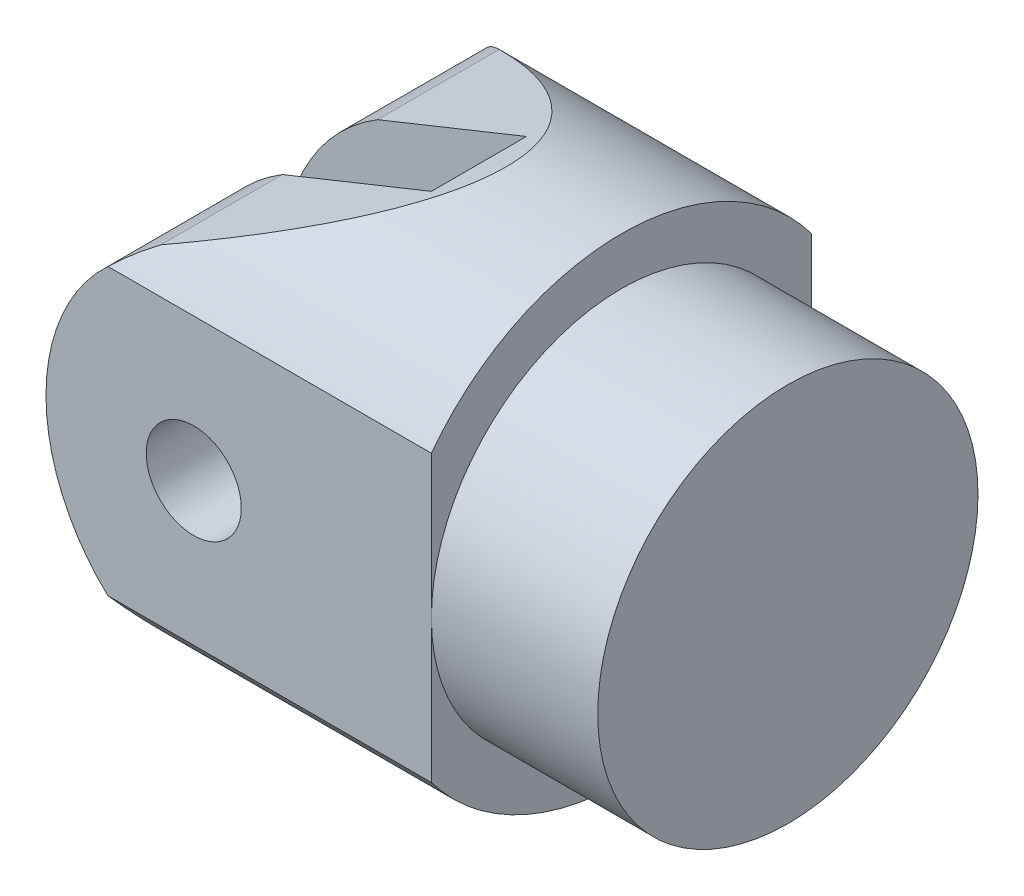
ISO-10303-21;
HEADER;
FILE_DESCRIPTION(('STEP AP214'),'2;1');
FILE_NAME('part.step','',(''),(''),'','','');
FILE_SCHEMA(('AUTOMOTIVE_DESIGN { 1 0 10303 214 1 1 1 1 }'));
ENDSEC;
DATA;
#1=APPLICATION_CONTEXT('core data for automotive mechanical design processes');
#2=APPLICATION_PROTOCOL_DEFINITION('international standard','automotive_design',2000,#1);
#3=PRODUCT_CONTEXT('',#1,'mechanical');
#4=PRODUCT('Part','Part','',(#3));
#5=PRODUCT_RELATED_PRODUCT_CATEGORY('part','',(#4));
#6=PRODUCT_DEFINITION_FORMATION('','',#4);
#7=PRODUCT_DEFINITION_CONTEXT('part definition',#1,'design');
#8=PRODUCT_DEFINITION('design','',#6,#7);
#9=PRODUCT_DEFINITION_SHAPE('','',#8);
#10=(LENGTH_UNIT() NAMED_UNIT(*) SI_UNIT(.MILLI.,.METRE.));
#11=(NAMED_UNIT(*) PLANE_ANGLE_UNIT() SI_UNIT($,.RADIAN.));
#12=(NAMED_UNIT(*) SI_UNIT($,.STERADIAN.) SOLID_ANGLE_UNIT());
#13=UNCERTAINTY_MEASURE_WITH_UNIT(LENGTH_MEASURE(1.E-05),#10,'distance_accuracy_value','');
#14=(GEOMETRIC_REPRESENTATION_CONTEXT(3) GLOBAL_UNCERTAINTY_ASSIGNED_CONTEXT((#13)) GLOBAL_UNIT_ASSIGNED_CONTEXT((#10,
#11,#12)) REPRESENTATION_CONTEXT('',''));
#15=CARTESIAN_POINT('',(0.,0.,0.));
#16=DIRECTION('',(0.,0.,1.));
#17=DIRECTION('',(1.,0.,0.));
#18=AXIS2_PLACEMENT_3D('',#15,#16,#17);
#19=CARTESIAN_POINT('',(-148.592394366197,0.,-50.));
#20=DIRECTION('',(0.373243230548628,-0.92773352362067,0.));
#21=DIRECTION('',(0.92773352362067,0.373243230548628,0.));
#22=AXIS2_PLACEMENT_3D('',#19,#20,#21);
#23=PLANE('',#22);
#24=DIRECTION('',(-0.92773352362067,-0.373243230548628,0.));
#25=VECTOR('',#24,1.);
#26=CARTESIAN_POINT('',(-148.592394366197,0.,-10.));
#27=LINE('',#26,#25);
#28=CARTESIAN_POINT('',(-30.,47.7117698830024,-10.));
#29=VERTEX_POINT('',#28);
#30=CARTESIAN_POINT('',(-61.339211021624,35.1034636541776,-10.));
#31=VERTEX_POINT('',#30);
#32=EDGE_CURVE('E140',#29,#31,#27,.T.);
#33=ORIENTED_EDGE('',*,*,#32,.F.);
#34=DIRECTION('',(0.,0.,1.));
#35=VECTOR('',#34,1.);
#36=CARTESIAN_POINT('',(-30.,47.7117698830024,-50.));
#37=LINE('',#36,#35);
#38=CARTESIAN_POINT('',(-30.,47.7117698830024,10.));
#39=VERTEX_POINT('',#38);
#40=EDGE_CURVE('E142',#29,#39,#37,.T.);
#41=ORIENTED_EDGE('',*,*,#40,.T.);
#42=DIRECTION('',(-0.92773352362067,-0.373243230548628,0.));
#43=VECTOR('',#42,1.);
#44=CARTESIAN_POINT('',(-148.592394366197,0.,10.));
#45=LINE('',#44,#43);
#46=CARTESIAN_POINT('',(-61.339211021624,35.1034636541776,10.));
#47=VERTEX_POINT('',#46);
#48=EDGE_CURVE('E126',#39,#47,#45,.T.);
#49=ORIENTED_EDGE('',*,*,#48,.T.);
#50=DIRECTION('',(0.,0.,1.));
#51=VECTOR('',#50,1.);
#52=CARTESIAN_POINT('',(-61.3392110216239,35.1034636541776,-50.));
#53=LINE('',#52,#51);
#54=CARTESIAN_POINT('',(-61.3392110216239,35.1034636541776,35.6054327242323));
#55=VERTEX_POINT('',#54);
#56=EDGE_CURVE('E167',#47,#55,#53,.T.);
#57=ORIENTED_EDGE('',*,*,#56,.T.);
#58=CARTESIAN_POINT('',(-148.592394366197,0.,0.));
#59=DIRECTION('',(0.373243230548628,-0.92773352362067,0.));
#60=DIRECTION('',(0.92773352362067,0.373243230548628,0.));
#61=AXIS2_PLACEMENT_3D('',#58,#59,#60);
#62=ELLIPSE('',#61,133.960902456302,50.);
#63=CARTESIAN_POINT('',(-61.339211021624,35.1034636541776,-35.6054327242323));
#64=VERTEX_POINT('',#63);
#65=EDGE_CURVE('E254',#55,#64,#62,.F.);
#66=ORIENTED_EDGE('',*,*,#65,.T.);
#67=EDGE_CURVE('E258',#64,#31,#53,.T.);
#68=ORIENTED_EDGE('',*,*,#67,.T.);
#69=EDGE_LOOP('',(#33,#41,#49,#57,#66,#68));
#70=FACE_BOUND('',#69,.T.);
#71=ADVANCED_FACE('F31',(#70),#23,.F.);
#72=CARTESIAN_POINT('',(-148.592394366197,0.,-50.));
#73=DIRECTION('',(0.373245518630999,0.927732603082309,0.));
#74=DIRECTION('',(-0.927732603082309,0.373245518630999,0.));
#75=AXIS2_PLACEMENT_3D('',#72,#73,#74);
#76=PLANE('',#75);
#77=DIRECTION('',(0.927732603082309,-0.373245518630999,0.));
#78=VECTOR('',#77,1.);
#79=CARTESIAN_POINT('',(-148.592394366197,0.,-10.));
#80=LINE('',#79,#78);
#81=CARTESIAN_POINT('',(-61.337994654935,-35.1042030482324,-10.));
#82=VERTEX_POINT('',#81);
#83=CARTESIAN_POINT('',(-30.,-47.7121097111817,-10.));
#84=VERTEX_POINT('',#83);
#85=EDGE_CURVE('E135',#82,#84,#80,.T.);
#86=ORIENTED_EDGE('',*,*,#85,.F.);
#87=DIRECTION('',(0.,0.,1.));
#88=VECTOR('',#87,1.);
#89=CARTESIAN_POINT('',(-61.337994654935,-35.1042030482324,-50.));
#90=LINE('',#89,#88);
#91=CARTESIAN_POINT('',(-61.337994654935,-35.1042030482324,-35.6047037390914));
#92=VERTEX_POINT('',#91);
#93=EDGE_CURVE('E229',#82,#92,#90,.F.);
#94=ORIENTED_EDGE('',*,*,#93,.T.);
#95=CARTESIAN_POINT('',(-148.592394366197,0.,0.));
#96=DIRECTION('',(0.373245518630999,0.927732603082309,0.));
#97=DIRECTION('',(0.927732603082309,-0.373245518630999,0.));
#98=AXIS2_PLACEMENT_3D('',#95,#96,#97);
#99=ELLIPSE('',#98,133.960081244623,50.);
#100=CARTESIAN_POINT('',(-61.337994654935,-35.1042030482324,35.6047037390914));
#101=VERTEX_POINT('',#100);
#102=EDGE_CURVE('E251',#92,#101,#99,.F.);
#103=ORIENTED_EDGE('',*,*,#102,.T.);
#104=CARTESIAN_POINT('',(-61.337994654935,-35.1042030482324,10.));
#105=VERTEX_POINT('',#104);
#106=EDGE_CURVE('E133',#101,#105,#90,.F.);
#107=ORIENTED_EDGE('',*,*,#106,.T.);
#108=DIRECTION('',(0.927732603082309,-0.373245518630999,0.));
#109=VECTOR('',#108,1.);
#110=CARTESIAN_POINT('',(-148.592394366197,0.,10.));
#111=LINE('',#110,#109);
#112=CARTESIAN_POINT('',(-30.,-47.7121097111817,10.));
#113=VERTEX_POINT('',#112);
#114=EDGE_CURVE('E48',#105,#113,#111,.T.);
#115=ORIENTED_EDGE('',*,*,#114,.T.);
#116=DIRECTION('',(0.,0.,-1.));
#117=VECTOR('',#116,1.);
#118=CARTESIAN_POINT('',(-30.,-47.7121097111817,-50.));
#119=LINE('',#118,#117);
#120=EDGE_CURVE('E11',#113,#84,#119,.T.);
#121=ORIENTED_EDGE('',*,*,#120,.T.);
#122=EDGE_LOOP('',(#86,#94,#103,#107,#115,#121));
#123=FACE_BOUND('',#122,.T.);
#124=ADVANCED_FACE('F130',(#123),#76,.F.);
#125=CARTESIAN_POINT('',(-40.,0.,-50.));
#126=DIRECTION('',(0.,0.,1.));
#127=DIRECTION('',(1.,0.,0.));
#128=AXIS2_PLACEMENT_3D('',#125,#126,#127);
#129=CYLINDRICAL_SURFACE('',#128,41.08059259);
#130=CARTESIAN_POINT('',(-40.,0.,-10.));
#131=DIRECTION('',(0.,0.,1.));
#132=DIRECTION('',(1.,0.,0.));
#133=AXIS2_PLACEMENT_3D('',#130,#131,#132);
#134=CIRCLE('',#133,41.08059259);
#135=EDGE_CURVE('E41',#31,#82,#134,.T.);
#136=ORIENTED_EDGE('',*,*,#135,.F.);
#137=ORIENTED_EDGE('',*,*,#67,.F.);
#138=CARTESIAN_POINT('',(-49.7787965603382,39.8997521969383,-30.1332005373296));
#139=CARTESIAN_POINT('',(-50.3716339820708,39.7544434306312,-30.3256256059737));
#140=CARTESIAN_POINT('',(-50.9570084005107,39.5969851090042,-30.5312087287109));
#141=CARTESIAN_POINT('',(-52.1122995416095,39.2590062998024,-30.9645847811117));
#142=CARTESIAN_POINT('',(-52.6822250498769,39.0784992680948,-31.1923647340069));
#143=CARTESIAN_POINT('',(-53.8054641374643,38.6959353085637,-31.6657081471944));
#144=CARTESIAN_POINT('',(-54.3588133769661,38.4939296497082,-31.9112288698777));
#145=CARTESIAN_POINT('',(-55.4505241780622,38.0688794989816,-32.4171183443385));
#146=CARTESIAN_POINT('',(-55.9888833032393,37.8458316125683,-32.6774894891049));
#147=CARTESIAN_POINT('',(-57.0496210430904,37.3799457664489,-33.2094016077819));
#148=CARTESIAN_POINT('',(-57.5720317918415,37.1371517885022,-33.4809171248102));
#149=CARTESIAN_POINT('',(-58.6023879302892,36.631891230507,-34.0329947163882));
#150=CARTESIAN_POINT('',(-59.1103316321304,36.3694223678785,-34.3135578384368));
#151=CARTESIAN_POINT('',(-60.6133859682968,35.5528467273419,-35.1655119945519));
#152=CARTESIAN_POINT('',(-61.5872728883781,34.9697681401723,-35.7469393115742));
#153=CARTESIAN_POINT('',(-63.4705783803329,33.7343110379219,-36.9149458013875));
#154=CARTESIAN_POINT('',(-64.3804988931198,33.082604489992,-37.5014313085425));
#155=CARTESIAN_POINT('',(-66.1450510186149,31.7065084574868,-38.6718635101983));
#156=CARTESIAN_POINT('',(-66.9996943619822,30.9821344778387,-39.2558107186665));
#157=CARTESIAN_POINT('',(-68.6525312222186,29.4603186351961,-40.4104297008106));
#158=CARTESIAN_POINT('',(-69.4506812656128,28.6628215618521,-40.9810910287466));
#159=CARTESIAN_POINT('',(-70.9862108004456,26.9954431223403,-42.0981336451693));
#160=CARTESIAN_POINT('',(-71.7235939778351,26.1255661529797,-42.6445164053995));
#161=CARTESIAN_POINT('',(-73.0492116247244,24.4210694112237,-43.6402036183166));
#162=CARTESIAN_POINT('',(-73.6447783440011,23.5944012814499,-44.0933555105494));
#163=CARTESIAN_POINT('',(-74.7800576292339,21.886387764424,-44.9656015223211));
#164=CARTESIAN_POINT('',(-75.3197721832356,21.0050443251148,-45.3846968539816));
#165=CARTESIAN_POINT('',(-76.3373625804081,19.1909180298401,-46.1810424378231));
#166=CARTESIAN_POINT('',(-76.8153176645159,18.2582033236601,-46.5583462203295));
#167=CARTESIAN_POINT('',(-77.7042622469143,16.3437122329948,-47.2643985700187));
#168=CARTESIAN_POINT('',(-78.1152624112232,15.3619436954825,-47.5931548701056));
#169=CARTESIAN_POINT('',(-78.8063745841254,13.5093110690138,-48.1485637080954));
#170=CARTESIAN_POINT('',(-79.0968971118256,12.6446980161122,-48.3831436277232));
#171=CARTESIAN_POINT('',(-79.6220168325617,10.8881075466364,-48.8084561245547));
#172=CARTESIAN_POINT('',(-79.8566194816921,9.99613280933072,-48.999192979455));
#173=CARTESIAN_POINT('',(-80.2665210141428,8.19020017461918,-49.3331887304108));
#174=CARTESIAN_POINT('',(-80.4418396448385,7.27624970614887,-49.4764634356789));
#175=CARTESIAN_POINT('',(-80.7305521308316,5.43213979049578,-49.7127337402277));
#176=CARTESIAN_POINT('',(-80.8439452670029,4.50198015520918,-49.8057287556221));
#177=CARTESIAN_POINT('',(-81.0071613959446,2.62940795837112,-49.9396636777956));
#178=CARTESIAN_POINT('',(-81.0567851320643,1.6869662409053,-49.9804404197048));
#179=CARTESIAN_POINT('',(-81.0909414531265,-0.199899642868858,-50.0085021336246));
#180=CARTESIAN_POINT('',(-81.0754739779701,-1.14432381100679,-49.9957870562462));
#181=CARTESIAN_POINT('',(-80.9797195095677,-3.02767475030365,-49.9171471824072));
#182=CARTESIAN_POINT('',(-80.8994294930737,-3.96660126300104,-49.8512199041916));
#183=CARTESIAN_POINT('',(-80.6754064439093,-5.83168899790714,-49.6675899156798));
#184=CARTESIAN_POINT('',(-80.5316741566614,-6.75785036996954,-49.5498878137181));
#185=CARTESIAN_POINT('',(-80.1914102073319,-8.54724500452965,-49.2719517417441));
#186=CARTESIAN_POINT('',(-79.9977114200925,-9.41137747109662,-49.114004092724));
#187=CARTESIAN_POINT('',(-79.5575566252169,-11.1171313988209,-48.7562177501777));
#188=CARTESIAN_POINT('',(-79.3111037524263,-11.9587541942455,-48.5563815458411));
#189=CARTESIAN_POINT('',(-78.7684454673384,-13.6155364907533,-48.1181014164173));
#190=CARTESIAN_POINT('',(-78.4722328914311,-14.4306921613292,-47.8796519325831));
#191=CARTESIAN_POINT('',(-77.833227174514,-16.0313680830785,-47.3677253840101));
#192=CARTESIAN_POINT('',(-77.4904251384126,-16.8168826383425,-47.0942416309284));
#193=CARTESIAN_POINT('',(-76.8797951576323,-18.1059863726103,-46.6098890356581));
#194=CARTESIAN_POINT('',(-76.6237064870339,-18.6183898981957,-46.4074771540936));
#195=CARTESIAN_POINT('',(-76.0928009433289,-19.6277850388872,-45.9896553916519));
#196=CARTESIAN_POINT('',(-75.8179879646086,-20.1247798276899,-45.7742482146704));
#197=CARTESIAN_POINT('',(-74.9665638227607,-21.5924511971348,-45.1100770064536));
#198=CARTESIAN_POINT('',(-74.3630439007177,-22.5396542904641,-44.6434242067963));
#199=CARTESIAN_POINT('',(-73.0900486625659,-24.3702664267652,-43.6711235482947));
#200=CARTESIAN_POINT('',(-72.4204424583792,-25.253542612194,-43.1653987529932));
#201=CARTESIAN_POINT('',(-71.0217855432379,-26.9532007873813,-42.1250224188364));
#202=CARTESIAN_POINT('',(-70.2927394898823,-27.7695880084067,-41.5903731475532));
#203=CARTESIAN_POINT('',(-68.7673398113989,-29.3475520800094,-40.4927100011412));
#204=CARTESIAN_POINT('',(-67.9700992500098,-30.1080491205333,-39.9293800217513));
#205=CARTESIAN_POINT('',(-66.3214384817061,-31.5595216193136,-38.7923496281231));
#206=CARTESIAN_POINT('',(-65.4700124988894,-32.2504896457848,-38.2186481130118));
#207=CARTESIAN_POINT('',(-63.7166493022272,-33.560851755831,-37.0732329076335));
#208=CARTESIAN_POINT('',(-62.8148397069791,-34.1804154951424,-36.501517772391));
#209=CARTESIAN_POINT('',(-60.9588871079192,-35.348867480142,-35.3711391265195));
#210=CARTESIAN_POINT('',(-60.0047568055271,-35.8977727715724,-34.8124724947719));
#211=CARTESIAN_POINT('',(-58.4367069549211,-36.7170463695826,-33.9419998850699));
#212=CARTESIAN_POINT('',(-57.8399343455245,-37.0107877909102,-33.6211062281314));
#213=CARTESIAN_POINT('',(-56.6268715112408,-37.5713792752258,-32.9934594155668));
#214=CARTESIAN_POINT('',(-56.0105880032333,-37.838238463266,-32.6867014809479));
#215=CARTESIAN_POINT('',(-54.757141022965,-38.3444839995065,-32.0913256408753));
#216=CARTESIAN_POINT('',(-54.1199528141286,-38.5838361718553,-31.8027304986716));
#217=CARTESIAN_POINT('',(-52.8247197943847,-39.0334619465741,-31.2492721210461));
#218=CARTESIAN_POINT('',(-52.1666589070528,-39.2437124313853,-30.9844278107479));
#219=CARTESIAN_POINT('',(-51.4983161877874,-39.4386081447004,-30.7342835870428));
#220=B_SPLINE_CURVE_WITH_KNOTS('',3,(#138,#139,#140,#141,#142,#143,#144,#145,#146,#147,#148,
#149,#150,#151,#152,#153,#154,#155,#156,#157,#158,#159,#160,#161,#162,#163,#164,#165,#166,#167,
#168,#169,#170,#171,#172,#173,#174,#175,#176,#177,#178,#179,#180,#181,#182,#183,#184,#185,#186,
#187,#188,#189,#190,#191,#192,#193,#194,#195,#196,#197,#198,#199,#200,#201,#202,#203,#204,#205,
#206,#207,#208,#209,#210,#211,#212,#213,#214,#215,#216,#217,#218,#219),.UNSPECIFIED.,.F.,.F.,(4,
2,2,2,2,2,2,2,2,2,2,2,2,2,2,2,2,2,2,2,2,2,2,2,2,2,2,2,2,2,2,2,2,2,2,2,2,2,2,2,4),(0.,
1.91941509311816,3.83771470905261,5.75153802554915,7.66567061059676,9.57565072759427,
11.4858527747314,15.3078703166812,19.0954399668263,22.8822031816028,26.6718494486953,
30.4612656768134,33.8035346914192,37.1456846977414,40.4835030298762,43.8207891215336,
46.6433202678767,49.4655759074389,52.2868905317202,55.1082379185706,57.9383797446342,
60.768524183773,63.5988006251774,66.4290438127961,69.1248245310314,71.8204451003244,
74.5164540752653,77.2129785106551,79.0350070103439,80.8566577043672,84.5005208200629,
88.1517514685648,91.8026962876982,95.5117785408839,99.221256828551,102.921731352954,
106.621311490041,108.836087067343,111.050108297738,113.266851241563,115.485345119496),.UNSPECIFIED.);
#221=CARTESIAN_POINT('',(-68.0644808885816,30.,-40.));
#222=VERTEX_POINT('',#221);
#223=EDGE_CURVE('E160',#64,#222,#220,.T.);
#224=ORIENTED_EDGE('',*,*,#223,.T.);
#225=CARTESIAN_POINT('',(-40.,0.,-40.));
#226=DIRECTION('',(0.,0.,1.));
#227=DIRECTION('',(1.,0.,0.));
#228=AXIS2_PLACEMENT_3D('',#225,#226,#227);
#229=CIRCLE('',#228,41.08059259);
#230=CARTESIAN_POINT('',(-68.0644808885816,-30.,-40.));
#231=VERTEX_POINT('',#230);
#232=EDGE_CURVE('E238',#222,#231,#229,.T.);
#233=ORIENTED_EDGE('',*,*,#232,.T.);
#234=EDGE_CURVE('E158',#231,#92,#220,.T.);
#235=ORIENTED_EDGE('',*,*,#234,.T.);
#236=ORIENTED_EDGE('',*,*,#93,.F.);
#237=EDGE_LOOP('',(#136,#137,#224,#233,#235,#236));
#238=FACE_BOUND('',#237,.T.);
#239=ADVANCED_FACE('F181',(#238),#129,.T.);
#240=CARTESIAN_POINT('',(0.,0.,-110.141421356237));
#241=DIRECTION('',(1.,0.,0.));
#242=DIRECTION('',(0.,0.,-1.));
#243=AXIS2_PLACEMENT_3D('',#240,#241,#242);
#244=PLANE('',#243);
#245=DIRECTION('',(0.,-1.,0.));
#246=VECTOR('',#245,1.);
#247=CARTESIAN_POINT('',(0.,30.,-40.));
#248=LINE('',#247,#246);
#249=CARTESIAN_POINT('',(0.,30.,-40.));
#250=VERTEX_POINT('',#249);
#251=CARTESIAN_POINT('',(0.,0.,-40.));
#252=VERTEX_POINT('',#251);
#253=EDGE_CURVE('E145',#250,#252,#248,.T.);
#254=ORIENTED_EDGE('',*,*,#253,.F.);
#255=CARTESIAN_POINT('',(0.,0.,0.));
#256=DIRECTION('',(1.,0.,0.));
#257=DIRECTION('',(0.,0.,-1.));
#258=AXIS2_PLACEMENT_3D('',#255,#256,#257);
#259=CIRCLE('',#258,50.);
#260=CARTESIAN_POINT('',(0.,30.,40.));
#261=VERTEX_POINT('',#260);
#262=EDGE_CURVE('E217',#250,#261,#259,.T.);
#263=ORIENTED_EDGE('',*,*,#262,.T.);
#264=DIRECTION('',(0.,1.,0.));
#265=VECTOR('',#264,1.);
#266=CARTESIAN_POINT('',(0.,30.,40.));
#267=LINE('',#266,#265);
#268=CARTESIAN_POINT('',(0.,0.,40.));
#269=VERTEX_POINT('',#268);
#270=EDGE_CURVE('E149',#269,#261,#267,.T.);
#271=ORIENTED_EDGE('',*,*,#270,.F.);
#272=CARTESIAN_POINT('',(0.,0.,0.));
#273=DIRECTION('',(1.,0.,0.));
#274=DIRECTION('',(0.,0.,-1.));
#275=AXIS2_PLACEMENT_3D('',#272,#273,#274);
#276=CIRCLE('',#275,40.);
#277=EDGE_CURVE('E219',#252,#269,#276,.T.);
#278=ORIENTED_EDGE('',*,*,#277,.F.);
#279=EDGE_LOOP('',(#254,#263,#271,#278));
#280=FACE_BOUND('',#279,.T.);
#281=ADVANCED_FACE('F199',(#280),#244,.T.);
#282=CARTESIAN_POINT('',(-100.,0.,0.));
#283=DIRECTION('',(1.,0.,0.));
#284=DIRECTION('',(0.,0.,-1.));
#285=AXIS2_PLACEMENT_3D('',#282,#283,#284);
#286=CYLINDRICAL_SURFACE('',#285,50.);
#287=DIRECTION('',(1.,0.,0.));
#288=VECTOR('',#287,1.);
#289=CARTESIAN_POINT('',(-81.08059259,-30.,-40.));
#290=LINE('',#289,#288);
#291=CARTESIAN_POINT('',(0.,-30.,-40.));
#292=VERTEX_POINT('',#291);
#293=EDGE_CURVE('E56',#231,#292,#290,.T.);
#294=ORIENTED_EDGE('',*,*,#293,.T.);
#295=CARTESIAN_POINT('',(0.,-30.,40.));
#296=VERTEX_POINT('',#295);
#297=EDGE_CURVE('E225',#296,#292,#259,.T.);
#298=ORIENTED_EDGE('',*,*,#297,.F.);
#299=DIRECTION('',(1.,0.,0.));
#300=VECTOR('',#299,1.);
#301=CARTESIAN_POINT('',(-81.08059259,-30.,40.));
#302=LINE('',#301,#300);
#303=CARTESIAN_POINT('',(-68.0644808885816,-30.,40.));
#304=VERTEX_POINT('',#303);
#305=EDGE_CURVE('E154',#304,#296,#302,.T.);
#306=ORIENTED_EDGE('',*,*,#305,.F.);
#307=CARTESIAN_POINT('',(-51.4983161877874,-39.4386081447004,30.7342835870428));
#308=CARTESIAN_POINT('',(-52.1003274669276,-39.2630662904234,30.9595751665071));
#309=CARTESIAN_POINT('',(-52.69401888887,-39.0750452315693,31.1968358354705));
#310=CARTESIAN_POINT('',(-53.8645752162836,-38.6752051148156,31.6911484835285));
#311=CARTESIAN_POINT('',(-54.4414482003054,-38.4633977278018,31.9481907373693));
#312=CARTESIAN_POINT('',(-55.5777713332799,-38.017363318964,32.4776828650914));
#313=CARTESIAN_POINT('',(-56.1372502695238,-37.7831762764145,32.7501049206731));
#314=CARTESIAN_POINT('',(-57.2402200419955,-37.2928173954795,33.307409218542));
#315=CARTESIAN_POINT('',(-57.7837086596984,-37.0366425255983,33.5922931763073));
#316=CARTESIAN_POINT('',(-58.8557581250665,-36.5025295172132,34.1719317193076));
#317=CARTESIAN_POINT('',(-59.3842945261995,-36.2245582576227,34.4667009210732));
#318=CARTESIAN_POINT('',(-60.425849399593,-35.647639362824,35.0630568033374));
#319=CARTESIAN_POINT('',(-60.9388674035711,-35.3486910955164,35.3646436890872));
#320=CARTESIAN_POINT('',(-61.9498202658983,-34.7299848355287,35.9724376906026));
#321=CARTESIAN_POINT('',(-62.4477476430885,-34.4102167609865,36.2786469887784));
#322=CARTESIAN_POINT('',(-63.4283121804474,-33.7502372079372,36.8934277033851));
#323=CARTESIAN_POINT('',(-63.9109491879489,-33.4100255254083,37.2019991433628));
#324=CARTESIAN_POINT('',(-65.3298254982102,-32.3634210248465,38.1243933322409));
#325=CARTESIAN_POINT('',(-66.2437037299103,-31.6269677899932,38.7389613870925));
#326=CARTESIAN_POINT('',(-68.0092768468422,-30.0745269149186,39.9561817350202));
#327=CARTESIAN_POINT('',(-68.860980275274,-29.2585502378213,40.5588356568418));
#328=CARTESIAN_POINT('',(-70.4982745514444,-27.54760452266,41.7397717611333));
#329=CARTESIAN_POINT('',(-71.2839189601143,-26.6527007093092,42.3180734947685));
#330=CARTESIAN_POINT('',(-72.4087549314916,-25.2516588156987,43.1584352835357));
#331=CARTESIAN_POINT('',(-72.7747506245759,-24.7748805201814,43.4340320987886));
#332=CARTESIAN_POINT('',(-73.4881773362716,-23.8017056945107,43.9748648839));
#333=CARTESIAN_POINT('',(-73.8356036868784,-23.3053042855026,44.2400982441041));
#334=CARTESIAN_POINT('',(-74.7137281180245,-21.98909882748,44.9144505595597));
#335=CARTESIAN_POINT('',(-75.2291255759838,-21.1541793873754,45.3142749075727));
#336=CARTESIAN_POINT('',(-76.2049267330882,-19.4369097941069,46.0769909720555));
#337=CARTESIAN_POINT('',(-76.6653423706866,-18.5545699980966,46.4398907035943));
#338=CARTESIAN_POINT('',(-77.5261073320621,-16.7454178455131,47.1224460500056));
#339=CARTESIAN_POINT('',(-77.9264864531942,-15.8186278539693,47.4421231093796));
#340=CARTESIAN_POINT('',(-78.6621381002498,-13.9243198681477,48.0322559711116));
#341=CARTESIAN_POINT('',(-78.9974096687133,-12.9568012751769,48.3027110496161));
#342=CARTESIAN_POINT('',(-79.6002663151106,-10.9778126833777,48.7907198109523));
#343=CARTESIAN_POINT('',(-79.8672350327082,-9.96603276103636,49.0077911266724));
#344=CARTESIAN_POINT('',(-80.210313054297,-8.42748557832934,49.2874212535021));
#345=CARTESIAN_POINT('',(-80.3151237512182,-7.91106097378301,49.3729798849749));
#346=CARTESIAN_POINT('',(-80.5051292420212,-6.87227614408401,49.5282483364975));
#347=CARTESIAN_POINT('',(-80.5903265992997,-6.34991670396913,49.5979602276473));
#348=CARTESIAN_POINT('',(-80.7406266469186,-5.30067960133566,49.7210389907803));
#349=CARTESIAN_POINT('',(-80.8057394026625,-4.77380433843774,49.7744140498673));
#350=CARTESIAN_POINT('',(-80.9155780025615,-3.7165803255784,49.8645008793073));
#351=CARTESIAN_POINT('',(-80.9603064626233,-3.18623203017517,49.901214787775));
#352=CARTESIAN_POINT('',(-81.0291383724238,-2.12331463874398,49.9577292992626));
#353=CARTESIAN_POINT('',(-81.0532428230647,-1.59074565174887,49.9775307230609));
#354=CARTESIAN_POINT('',(-81.0807023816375,-0.524767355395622,50.0000897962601));
#355=CARTESIAN_POINT('',(-81.0840582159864,0.00864192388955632,50.0028480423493));
#356=CARTESIAN_POINT('',(-81.0648410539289,1.46429824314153,49.9870573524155));
#357=CARTESIAN_POINT('',(-81.0215583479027,2.38622727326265,49.9514897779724));
#358=CARTESIAN_POINT('',(-80.8734826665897,4.22154143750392,49.8299583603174));
#359=CARTESIAN_POINT('',(-80.7686963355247,5.13492748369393,49.7439999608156));
#360=CARTESIAN_POINT('',(-80.4993177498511,6.94688682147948,49.5234658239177));
#361=CARTESIAN_POINT('',(-80.3347243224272,7.84545982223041,49.3888891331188));
#362=CARTESIAN_POINT('',(-79.9482148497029,9.62193918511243,49.0737432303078));
#363=CARTESIAN_POINT('',(-79.7262963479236,10.4998446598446,48.8931720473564));
#364=CARTESIAN_POINT('',(-79.2297497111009,12.2246612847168,48.4905887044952));
#365=CARTESIAN_POINT('',(-78.9554547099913,13.0717300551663,48.2688386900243));
#366=CARTESIAN_POINT('',(-78.3566406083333,14.7365469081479,47.7868729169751));
#367=CARTESIAN_POINT('',(-78.0321233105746,15.5542960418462,47.5266585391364));
#368=CARTESIAN_POINT('',(-77.3363027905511,17.157486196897,46.971697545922));
#369=CARTESIAN_POINT('',(-76.9649972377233,17.9429256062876,46.6769492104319));
#370=CARTESIAN_POINT('',(-76.1788995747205,19.4794034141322,46.0569134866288));
#371=CARTESIAN_POINT('',(-75.7640988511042,20.2304349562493,45.7316200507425));
#372=CARTESIAN_POINT('',(-75.0189199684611,21.4862781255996,45.1516526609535));
#373=CARTESIAN_POINT('',(-74.698400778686,21.9999874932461,44.9034457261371));
#374=CARTESIAN_POINT('',(-74.0380068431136,23.0085296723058,44.3951174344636));
#375=CARTESIAN_POINT('',(-73.6981356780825,23.5033659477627,44.1349982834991));
#376=CARTESIAN_POINT('',(-72.6505823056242,24.9596690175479,43.3386548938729));
#377=CARTESIAN_POINT('',(-71.9150896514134,25.8927130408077,42.7865460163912));
#378=CARTESIAN_POINT('',(-70.3745249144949,27.6840009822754,41.6500321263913));
#379=CARTESIAN_POINT('',(-69.5692401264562,28.5419989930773,41.065530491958));
#380=CARTESIAN_POINT('',(-67.8958669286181,30.1795628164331,39.8775246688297));
#381=CARTESIAN_POINT('',(-67.0277873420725,30.9591396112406,39.2740231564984));
#382=CARTESIAN_POINT('',(-65.2153541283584,32.4531223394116,38.0492288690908));
#383=CARTESIAN_POINT('',(-64.2699118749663,33.1661089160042,37.4278111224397));
#384=CARTESIAN_POINT('',(-62.8057943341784,34.1739934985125,36.5013285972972));
#385=CARTESIAN_POINT('',(-62.3099421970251,34.4997766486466,36.1933512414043));
#386=CARTESIAN_POINT('',(-61.3028296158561,35.1305794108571,35.5813902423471));
#387=CARTESIAN_POINT('',(-60.7915706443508,35.4356009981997,35.2774062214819));
#388=CARTESIAN_POINT('',(-59.7559630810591,36.0231833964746,34.6771657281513));
#389=CARTESIAN_POINT('',(-59.2316891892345,36.3058450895,34.3808791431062));
#390=CARTESIAN_POINT('',(-58.1674001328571,36.8499371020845,33.7970610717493));
#391=CARTESIAN_POINT('',(-57.6273839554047,37.1113660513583,33.5095301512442));
#392=CARTESIAN_POINT('',(-56.5318218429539,37.6121845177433,32.9464025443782));
#393=CARTESIAN_POINT('',(-55.9762897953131,37.8515929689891,32.6707957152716));
#394=CARTESIAN_POINT('',(-54.8490389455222,38.3078414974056,32.1346094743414));
#395=CARTESIAN_POINT('',(-54.277323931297,38.5246868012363,31.8740265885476));
#396=CARTESIAN_POINT('',(-53.3808094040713,38.841753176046,31.4857047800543));
#397=CARTESIAN_POINT('',(-53.0617546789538,38.9502249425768,31.3513668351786));
#398=CARTESIAN_POINT('',(-52.4187824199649,39.1599701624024,31.088984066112));
#399=CARTESIAN_POINT('',(-52.0948656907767,39.2612447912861,30.9609382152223));
#400=CARTESIAN_POINT('',(-51.4417775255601,39.4565217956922,30.7116912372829));
#401=CARTESIAN_POINT('',(-51.1126005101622,39.5505157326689,30.5904980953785));
#402=CARTESIAN_POINT('',(-50.4493396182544,39.7309013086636,30.3558464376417));
#403=CARTESIAN_POINT('',(-50.1152544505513,39.8172909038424,30.2423900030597));
#404=CARTESIAN_POINT('',(-49.7787965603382,39.8997521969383,30.1332005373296));
#405=B_SPLINE_CURVE_WITH_KNOTS('',3,(#307,#308,#309,#310,#311,#312,#313,#314,#315,#316,#317,
#318,#319,#320,#321,#322,#323,#324,#325,#326,#327,#328,#329,#330,#331,#332,#333,#334,#335,#336,
#337,#338,#339,#340,#341,#342,#343,#344,#345,#346,#347,#348,#349,#350,#351,#352,#353,#354,#355,
#356,#357,#358,#359,#360,#361,#362,#363,#364,#365,#366,#367,#368,#369,#370,#371,#372,#373,#374,
#375,#376,#377,#378,#379,#380,#381,#382,#383,#384,#385,#386,#387,#388,#389,#390,#391,#392,#393,
#394,#395,#396,#397,#398,#399,#400,#401,#402,#403,#404),.UNSPECIFIED.,.F.,.F.,(4,2,2,2,2,2,2,2,
2,2,2,2,2,2,2,2,2,2,2,2,2,2,2,2,2,2,2,2,2,2,2,2,2,2,2,2,2,2,2,2,2,2,2,2,2,2,2,2,4),(0.,
1.99843496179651,3.99589363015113,5.98984844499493,7.98407861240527,9.98140016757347,
11.9787819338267,13.9771382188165,15.9755144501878,19.9458736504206,23.9156862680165,
27.8822484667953,29.8653987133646,31.8490451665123,35.0244921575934,38.1992483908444,
41.3724236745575,44.5456456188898,47.7465657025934,49.3476092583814,50.9484434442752,
52.5484740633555,54.1482992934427,55.7480468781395,57.347738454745,60.1148592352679,
62.8816811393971,65.6485573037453,68.4155520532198,71.1655010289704,73.9153513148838,
76.6653386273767,79.415871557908,81.3784080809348,83.3405826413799,87.2657455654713,
91.2033228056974,95.1403478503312,99.1479730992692,101.152975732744,103.157787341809,
105.152965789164,107.148272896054,109.141847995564,111.134960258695,112.223164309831,
113.311190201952,114.400458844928,115.490019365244),.UNSPECIFIED.);
#406=EDGE_CURVE('E168',#101,#304,#405,.T.);
#407=ORIENTED_EDGE('',*,*,#406,.F.);
#408=ORIENTED_EDGE('',*,*,#102,.F.);
#409=ORIENTED_EDGE('',*,*,#234,.F.);
#410=EDGE_LOOP('',(#294,#298,#306,#407,#408,#409));
#411=FACE_BOUND('',#410,.T.);
#412=ADVANCED_FACE('F197',(#411),#286,.T.);
#413=EDGE_CURVE('E144',#252,#292,#248,.T.);
#414=ORIENTED_EDGE('',*,*,#413,.F.);
#415=EDGE_CURVE('E231',#269,#252,#276,.T.);
#416=ORIENTED_EDGE('',*,*,#415,.F.);
#417=EDGE_CURVE('E151',#296,#269,#267,.T.);
#418=ORIENTED_EDGE('',*,*,#417,.F.);
#419=ORIENTED_EDGE('',*,*,#297,.T.);
#420=EDGE_LOOP('',(#414,#416,#418,#419));
#421=FACE_BOUND('',#420,.T.);
#422=ADVANCED_FACE('F195',(#421),#244,.T.);
#423=DIRECTION('',(1.,0.,0.));
#424=VECTOR('',#423,1.);
#425=CARTESIAN_POINT('',(-81.08059259,30.,-40.));
#426=LINE('',#425,#424);
#427=EDGE_CURVE('E147',#222,#250,#426,.T.);
#428=ORIENTED_EDGE('',*,*,#427,.F.);
#429=ORIENTED_EDGE('',*,*,#223,.F.);
#430=ORIENTED_EDGE('',*,*,#65,.F.);
#431=CARTESIAN_POINT('',(-68.0644808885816,30.,40.));
#432=VERTEX_POINT('',#431);
#433=EDGE_CURVE('E259',#432,#55,#405,.T.);
#434=ORIENTED_EDGE('',*,*,#433,.F.);
#435=DIRECTION('',(1.,0.,0.));
#436=VECTOR('',#435,1.);
#437=CARTESIAN_POINT('',(-81.08059259,30.,40.));
#438=LINE('',#437,#436);
#439=EDGE_CURVE('E155',#432,#261,#438,.T.);
#440=ORIENTED_EDGE('',*,*,#439,.T.);
#441=ORIENTED_EDGE('',*,*,#262,.F.);
#442=EDGE_LOOP('',(#428,#429,#430,#434,#440,#441));
#443=FACE_BOUND('',#442,.T.);
#444=ADVANCED_FACE('F33',(#443),#286,.T.);
#445=CARTESIAN_POINT('',(35.,0.,0.));
#446=DIRECTION('',(-1.,0.,0.));
#447=DIRECTION('',(0.,0.,1.));
#448=AXIS2_PLACEMENT_3D('',#445,#446,#447);
#449=CYLINDRICAL_SURFACE('',#448,40.);
#450=CARTESIAN_POINT('',(35.,0.,0.));
#451=DIRECTION('',(1.,0.,0.));
#452=DIRECTION('',(0.,0.,-1.));
#453=AXIS2_PLACEMENT_3D('',#450,#451,#452);
#454=CIRCLE('',#453,40.);
#455=CARTESIAN_POINT('',(35.,0.,-40.));
#456=VERTEX_POINT('',#455);
#457=EDGE_CURVE('E226',#456,#456,#454,.T.);
#458=ORIENTED_EDGE('',*,*,#457,.F.);
#459=EDGE_LOOP('',(#458));
#460=FACE_BOUND('',#459,.T.);
#461=ORIENTED_EDGE('',*,*,#415,.T.);
#462=ORIENTED_EDGE('',*,*,#277,.T.);
#463=EDGE_LOOP('',(#461,#462));
#464=FACE_BOUND('',#463,.T.);
#465=ADVANCED_FACE('F191',(#460,#464),#449,.T.);
#466=CARTESIAN_POINT('',(35.,0.,-110.141421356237));
#467=DIRECTION('',(1.,0.,0.));
#468=DIRECTION('',(0.,0.,-1.));
#469=AXIS2_PLACEMENT_3D('',#466,#467,#468);
#470=PLANE('',#469);
#471=ORIENTED_EDGE('',*,*,#457,.T.);
#472=EDGE_LOOP('',(#471));
#473=FACE_BOUND('',#472,.T.);
#474=ADVANCED_FACE('F179',(#473),#470,.T.);
#475=ORIENTED_EDGE('',*,*,#56,.F.);
#476=CARTESIAN_POINT('',(-40.,0.,10.));
#477=DIRECTION('',(0.,0.,1.));
#478=DIRECTION('',(1.,0.,0.));
#479=AXIS2_PLACEMENT_3D('',#476,#477,#478);
#480=CIRCLE('',#479,41.08059259);
#481=EDGE_CURVE('E240',#47,#105,#480,.T.);
#482=ORIENTED_EDGE('',*,*,#481,.T.);
#483=ORIENTED_EDGE('',*,*,#106,.F.);
#484=ORIENTED_EDGE('',*,*,#406,.T.);
#485=CARTESIAN_POINT('',(-40.,0.,40.));
#486=DIRECTION('',(0.,0.,-1.));
#487=DIRECTION('',(-1.,0.,0.));
#488=AXIS2_PLACEMENT_3D('',#485,#486,#487);
#489=CIRCLE('',#488,41.08059259);
#490=EDGE_CURVE('E236',#304,#432,#489,.T.);
#491=ORIENTED_EDGE('',*,*,#490,.T.);
#492=ORIENTED_EDGE('',*,*,#433,.T.);
#493=EDGE_LOOP('',(#475,#482,#483,#484,#491,#492));
#494=FACE_BOUND('',#493,.T.);
#495=ADVANCED_FACE('F173',(#494),#129,.T.);
#496=CARTESIAN_POINT('',(-81.08059259,30.,40.));
#497=DIRECTION('',(0.,0.,-1.));
#498=DIRECTION('',(-1.,0.,0.));
#499=AXIS2_PLACEMENT_3D('',#496,#497,#498);
#500=PLANE('',#499);
#501=CARTESIAN_POINT('',(-50.,0.,40.));
#502=DIRECTION('',(0.,0.,1.));
#503=DIRECTION('',(1.,0.,0.));
#504=AXIS2_PLACEMENT_3D('',#501,#502,#503);
#505=CIRCLE('',#504,10.);
#506=CARTESIAN_POINT('',(-40.,0.,40.));
#507=VERTEX_POINT('',#506);
#508=EDGE_CURVE('E298',#507,#507,#505,.T.);
#509=ORIENTED_EDGE('',*,*,#508,.F.);
#510=EDGE_LOOP('',(#509));
#511=FACE_BOUND('',#510,.T.);
#512=ORIENTED_EDGE('',*,*,#490,.F.);
#513=ORIENTED_EDGE('',*,*,#305,.T.);
#514=ORIENTED_EDGE('',*,*,#417,.T.);
#515=ORIENTED_EDGE('',*,*,#270,.T.);
#516=ORIENTED_EDGE('',*,*,#439,.F.);
#517=EDGE_LOOP('',(#512,#513,#514,#515,#516));
#518=FACE_BOUND('',#517,.T.);
#519=ADVANCED_FACE('F178',(#511,#518),#500,.F.);
#520=CARTESIAN_POINT('',(-81.08059259,30.,-40.));
#521=DIRECTION('',(0.,0.,1.));
#522=DIRECTION('',(1.,0.,0.));
#523=AXIS2_PLACEMENT_3D('',#520,#521,#522);
#524=PLANE('',#523);
#525=CARTESIAN_POINT('',(-50.,0.,-40.));
#526=DIRECTION('',(0.,0.,1.));
#527=DIRECTION('',(1.,0.,0.));
#528=AXIS2_PLACEMENT_3D('',#525,#526,#527);
#529=CIRCLE('',#528,10.);
#530=CARTESIAN_POINT('',(-40.,0.,-40.));
#531=VERTEX_POINT('',#530);
#532=EDGE_CURVE('E297',#531,#531,#529,.T.);
#533=ORIENTED_EDGE('',*,*,#532,.T.);
#534=EDGE_LOOP('',(#533));
#535=FACE_BOUND('',#534,.T.);
#536=ORIENTED_EDGE('',*,*,#427,.T.);
#537=ORIENTED_EDGE('',*,*,#253,.T.);
#538=ORIENTED_EDGE('',*,*,#413,.T.);
#539=ORIENTED_EDGE('',*,*,#293,.F.);
#540=ORIENTED_EDGE('',*,*,#232,.F.);
#541=EDGE_LOOP('',(#536,#537,#538,#539,#540));
#542=FACE_BOUND('',#541,.T.);
#543=ADVANCED_FACE('F268',(#535,#542),#524,.F.);
#544=CARTESIAN_POINT('',(-30.,52.8885883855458,-10.));
#545=DIRECTION('',(1.,0.,0.));
#546=DIRECTION('',(0.,1.,0.));
#547=AXIS2_PLACEMENT_3D('',#544,#545,#546);
#548=PLANE('',#547);
#549=DIRECTION('',(0.,1.,0.));
#550=VECTOR('',#549,1.);
#551=CARTESIAN_POINT('',(-30.,52.8885883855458,-10.));
#552=LINE('',#551,#550);
#553=EDGE_CURVE('E121',#84,#29,#552,.T.);
#554=ORIENTED_EDGE('',*,*,#553,.F.);
#555=ORIENTED_EDGE('',*,*,#120,.F.);
#556=DIRECTION('',(0.,1.,0.));
#557=VECTOR('',#556,1.);
#558=CARTESIAN_POINT('',(-30.,52.8885883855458,10.));
#559=LINE('',#558,#557);
#560=EDGE_CURVE('E118',#113,#39,#559,.T.);
#561=ORIENTED_EDGE('',*,*,#560,.T.);
#562=ORIENTED_EDGE('',*,*,#40,.F.);
#563=EDGE_LOOP('',(#554,#555,#561,#562));
#564=FACE_BOUND('',#563,.T.);
#565=ADVANCED_FACE('F117',(#564),#548,.F.);
#566=CARTESIAN_POINT('',(-90.,-55.3677409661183,-10.));
#567=DIRECTION('',(0.,0.,1.));
#568=DIRECTION('',(1.,0.,0.));
#569=AXIS2_PLACEMENT_3D('',#566,#567,#568);
#570=PLANE('',#569);
#571=CARTESIAN_POINT('',(-50.,0.,-10.));
#572=DIRECTION('',(0.,0.,1.));
#573=DIRECTION('',(1.,0.,0.));
#574=AXIS2_PLACEMENT_3D('',#571,#572,#573);
#575=CIRCLE('',#574,10.);
#576=CARTESIAN_POINT('',(-40.,0.,-10.));
#577=VERTEX_POINT('',#576);
#578=EDGE_CURVE('E127',#577,#577,#575,.T.);
#579=ORIENTED_EDGE('',*,*,#578,.F.);
#580=EDGE_LOOP('',(#579));
#581=FACE_BOUND('',#580,.T.);
#582=ORIENTED_EDGE('',*,*,#32,.T.);
#583=ORIENTED_EDGE('',*,*,#135,.T.);
#584=ORIENTED_EDGE('',*,*,#85,.T.);
#585=ORIENTED_EDGE('',*,*,#553,.T.);
#586=EDGE_LOOP('',(#582,#583,#584,#585));
#587=FACE_BOUND('',#586,.T.);
#588=ADVANCED_FACE('F244',(#581,#587),#570,.T.);
#589=CARTESIAN_POINT('',(-90.,-55.3677409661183,10.));
#590=DIRECTION('',(0.,0.,1.));
#591=DIRECTION('',(1.,0.,0.));
#592=AXIS2_PLACEMENT_3D('',#589,#590,#591);
#593=PLANE('',#592);
#594=CARTESIAN_POINT('',(-50.,0.,10.));
#595=DIRECTION('',(0.,0.,1.));
#596=DIRECTION('',(1.,0.,0.));
#597=AXIS2_PLACEMENT_3D('',#594,#595,#596);
#598=CIRCLE('',#597,10.);
#599=CARTESIAN_POINT('',(-40.,0.,10.));
#600=VERTEX_POINT('',#599);
#601=EDGE_CURVE('E36',#600,#600,#598,.T.);
#602=ORIENTED_EDGE('',*,*,#601,.T.);
#603=EDGE_LOOP('',(#602));
#604=FACE_BOUND('',#603,.T.);
#605=ORIENTED_EDGE('',*,*,#560,.F.);
#606=ORIENTED_EDGE('',*,*,#114,.F.);
#607=ORIENTED_EDGE('',*,*,#481,.F.);
#608=ORIENTED_EDGE('',*,*,#48,.F.);
#609=EDGE_LOOP('',(#605,#606,#607,#608));
#610=FACE_BOUND('',#609,.T.);
#611=ADVANCED_FACE('F124',(#604,#610),#593,.F.);
#612=CARTESIAN_POINT('',(-50.,0.,-40.));
#613=DIRECTION('',(0.,0.,1.));
#614=DIRECTION('',(1.,0.,0.));
#615=AXIS2_PLACEMENT_3D('',#612,#613,#614);
#616=CYLINDRICAL_SURFACE('',#615,10.);
#617=ORIENTED_EDGE('',*,*,#508,.T.);
#618=EDGE_LOOP('',(#617));
#619=FACE_BOUND('',#618,.T.);
#620=ORIENTED_EDGE('',*,*,#601,.F.);
#621=EDGE_LOOP('',(#620));
#622=FACE_BOUND('',#621,.T.);
#623=ADVANCED_FACE('F281',(#619,#622),#616,.F.);
#624=ORIENTED_EDGE('',*,*,#578,.T.);
#625=EDGE_LOOP('',(#624));
#626=FACE_BOUND('',#625,.T.);
#627=ORIENTED_EDGE('',*,*,#532,.F.);
#628=EDGE_LOOP('',(#627));
#629=FACE_BOUND('',#628,.T.);
#630=ADVANCED_FACE('F286',(#626,#629),#616,.F.);
#631=CLOSED_SHELL('',(#71,#124,#239,#281,#412,#422,#444,#465,#474,#495,#519,#543,#565,#588,#611,
#623,#630));
#632=MANIFOLD_SOLID_BREP('B2',#631);
#633=ADVANCED_BREP_SHAPE_REPRESENTATION('',(#18,#632),#14);
#634=SHAPE_DEFINITION_REPRESENTATION(#9,#633);
ENDSEC;
END-ISO-10303-21;
